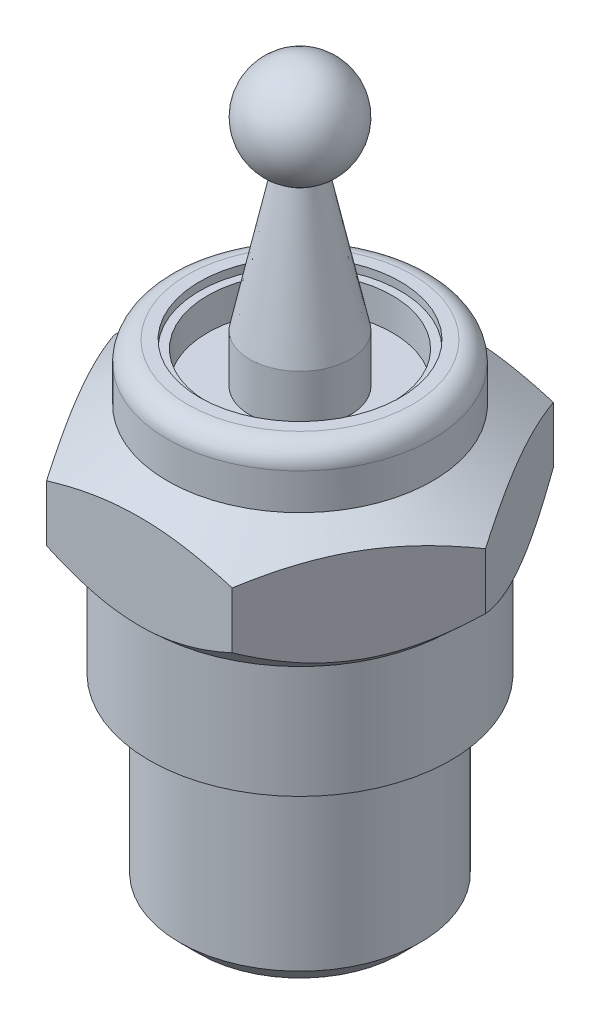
from build123d import *

# Parameters (mm, degrees)
BOSS_EXTRU_1_DEPTH = 3


with BuildPart() as part:
    # Esquisse1 → Base-R_volution (revolve)
    with BuildSketch(Plane(origin=(0, 0, 0), x_dir=(-1, 0, 0), z_dir=(0, 0, -1)), mode=Mode.PRIVATE) as base_r_volution_sk:
        with BuildLine():
            Line((-1.1, 0.423904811), (0, 1.423904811))
            Line((0, 1.423904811), (0, 15.473904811))
            ThreePointArc((0, 15.473904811), (-1.222404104, 14.485110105), (-0.510877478, 13.08306994))
            Line((-0.510877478, 13.08306994), (-1.25, 9.623904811))
            Line((-1.25, 9.623904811), (-1.25, 8.423904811))
            Line((-1.25, 8.423904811), (-2.3, 8.423904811))
            Line((-2.3, 8.423904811), (-2.3, 9.223904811))
            Line((-2.3, 9.223904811), (-2.5, 9.223904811))
            Line((-2.5, 9.223904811), (-2.5, 9.423904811))
            Line((-2.5, 9.423904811), (-2.8, 9.423904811))
            ThreePointArc((-2.8, 9.423904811), (-3.153553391, 9.277458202), (-3.3, 8.923904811))
            Line((-3.3, 8.923904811), (-3.3, 8.023904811))
            Line((-3.3, 8.023904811), (-3.75, 8.023904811))
            Line((-3.75, 8.023904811), (-3.75, 2.223904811))
            Line((-3.75, 2.223904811), (-3, 2.223904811))
            Line((-3, 2.223904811), (-3, -2.076095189))
            Line((-3, -2.076095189), (-2.5, -2.576095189))
            Line((-2.5, -2.576095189), (-1.35, -2.576095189))
            Line((-1.35, -2.576095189), (-1.1, -2.326095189))
            Line((-1.1, -2.326095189), (-1.1, 0.423904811))
        make_face()
    revolve(base_r_volution_sk.sketch.rotate(Axis((0, -2.577345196, 0), (0, 1, 0)), 270), axis=Axis((0, -2.577345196, 0), (0, 1, 0)))

    # Esquisse2 → Boss.-Extru.1 (add)
    with BuildSketch(Plane(origin=(0, 8.023904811, 0), x_dir=(-1, 0, 0), z_dir=(0, 1, 0))):
        Polygon((-4.618802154, 0), (-2.309401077, -4), (2.309401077, -4), (4.618802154, 0), (2.309401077, 4), (-2.309401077, 4), align=None)
    extrude(amount=-BOSS_EXTRU_1_DEPTH)

    # Esquisse3 → Enl_vement de mati_re-R_volution1 (revolve, cut)
    with BuildSketch(Plane.XY, mode=Mode.PRIVATE) as enl_vement_de_mati_re_r_volution1_sk:
        Polygon((4.618802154, 8.023904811), (4.618802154, 7.223904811), (3.3, 8.023904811), align=None)
        Polygon((4.618802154, 5.023904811), (3.75, 5.023904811), (4.618802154, 5.823904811), align=None)
    revolve(enl_vement_de_mati_re_r_volution1_sk.sketch.rotate(Axis((0, 10.932037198, 0), (0, -1, 0)), 180), axis=Axis((0, 10.932037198, 0), (0, -1, 0)), mode=Mode.SUBTRACT)


solid = part.part
